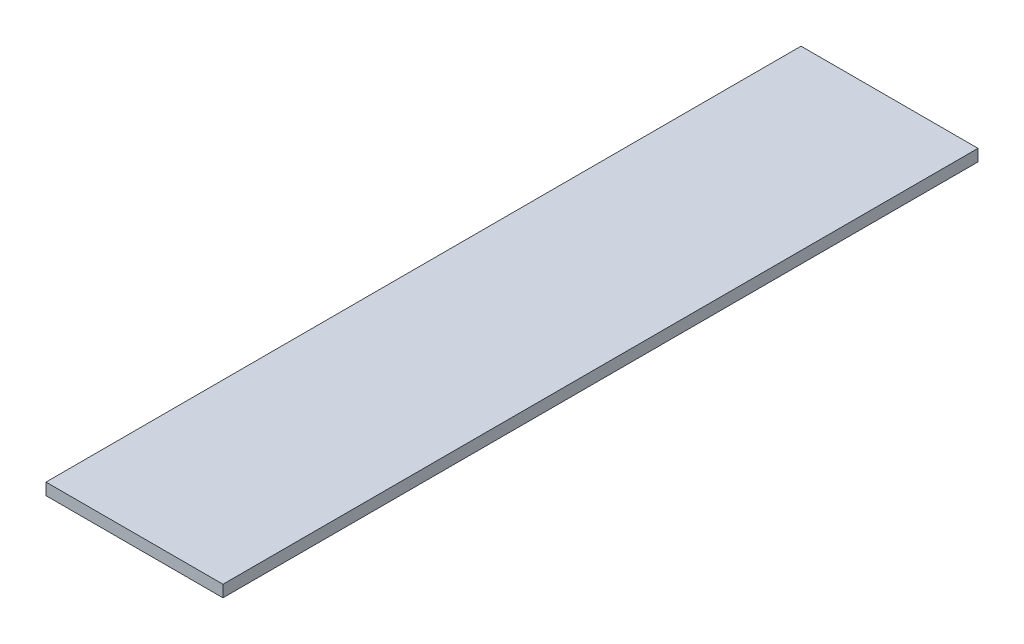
ISO-10303-21;
HEADER;
FILE_DESCRIPTION(('STEP AP214'),'2;1');
FILE_NAME('part.step','',(''),(''),'','','');
FILE_SCHEMA(('AUTOMOTIVE_DESIGN { 1 0 10303 214 1 1 1 1 }'));
ENDSEC;
DATA;
#1=APPLICATION_CONTEXT('core data for automotive mechanical design processes');
#2=APPLICATION_PROTOCOL_DEFINITION('international standard','automotive_design',2000,#1);
#3=PRODUCT_CONTEXT('',#1,'mechanical');
#4=PRODUCT('Part','Part','',(#3));
#5=PRODUCT_RELATED_PRODUCT_CATEGORY('part','',(#4));
#6=PRODUCT_DEFINITION_FORMATION('','',#4);
#7=PRODUCT_DEFINITION_CONTEXT('part definition',#1,'design');
#8=PRODUCT_DEFINITION('design','',#6,#7);
#9=PRODUCT_DEFINITION_SHAPE('','',#8);
#10=(LENGTH_UNIT() NAMED_UNIT(*) SI_UNIT(.MILLI.,.METRE.));
#11=(NAMED_UNIT(*) PLANE_ANGLE_UNIT() SI_UNIT($,.RADIAN.));
#12=(NAMED_UNIT(*) SI_UNIT($,.STERADIAN.) SOLID_ANGLE_UNIT());
#13=UNCERTAINTY_MEASURE_WITH_UNIT(LENGTH_MEASURE(1.E-05),#10,'distance_accuracy_value','');
#14=(GEOMETRIC_REPRESENTATION_CONTEXT(3) GLOBAL_UNCERTAINTY_ASSIGNED_CONTEXT((#13)) GLOBAL_UNIT_ASSIGNED_CONTEXT((#10,
#11,#12)) REPRESENTATION_CONTEXT('',''));
#15=CARTESIAN_POINT('',(0.,0.,0.));
#16=DIRECTION('',(0.,0.,1.));
#17=DIRECTION('',(1.,0.,0.));
#18=AXIS2_PLACEMENT_3D('',#15,#16,#17);
#19=CARTESIAN_POINT('',(0.,0.,-64.));
#20=DIRECTION('',(-1.,0.,0.));
#21=DIRECTION('',(0.,0.,1.));
#22=AXIS2_PLACEMENT_3D('',#19,#20,#21);
#23=PLANE('',#22);
#24=DIRECTION('',(0.,-1.,0.));
#25=VECTOR('',#24,1.);
#26=CARTESIAN_POINT('',(0.,0.,0.));
#27=LINE('',#26,#25);
#28=CARTESIAN_POINT('',(0.,1.,0.));
#29=VERTEX_POINT('',#28);
#30=CARTESIAN_POINT('',(0.,0.,0.));
#31=VERTEX_POINT('',#30);
#32=EDGE_CURVE('E66',#29,#31,#27,.T.);
#33=ORIENTED_EDGE('',*,*,#32,.F.);
#34=DIRECTION('',(0.,0.,1.));
#35=VECTOR('',#34,1.);
#36=CARTESIAN_POINT('',(0.,1.,-64.));
#37=LINE('',#36,#35);
#38=CARTESIAN_POINT('',(0.,1.,-64.));
#39=VERTEX_POINT('',#38);
#40=EDGE_CURVE('E11',#39,#29,#37,.T.);
#41=ORIENTED_EDGE('',*,*,#40,.F.);
#42=DIRECTION('',(0.,-1.,0.));
#43=VECTOR('',#42,1.);
#44=CARTESIAN_POINT('',(0.,0.,-64.));
#45=LINE('',#44,#43);
#46=CARTESIAN_POINT('',(0.,0.,-64.));
#47=VERTEX_POINT('',#46);
#48=EDGE_CURVE('E68',#39,#47,#45,.T.);
#49=ORIENTED_EDGE('',*,*,#48,.T.);
#50=DIRECTION('',(0.,0.,1.));
#51=VECTOR('',#50,1.);
#52=CARTESIAN_POINT('',(0.,0.,-64.));
#53=LINE('',#52,#51);
#54=EDGE_CURVE('E29',#47,#31,#53,.T.);
#55=ORIENTED_EDGE('',*,*,#54,.T.);
#56=EDGE_LOOP('',(#33,#41,#49,#55));
#57=FACE_BOUND('',#56,.T.);
#58=ADVANCED_FACE('F26',(#57),#23,.T.);
#59=CARTESIAN_POINT('',(0.,1.,-64.));
#60=DIRECTION('',(0.,1.,0.));
#61=DIRECTION('',(0.,0.,1.));
#62=AXIS2_PLACEMENT_3D('',#59,#60,#61);
#63=PLANE('',#62);
#64=DIRECTION('',(-1.,0.,0.));
#65=VECTOR('',#64,1.);
#66=CARTESIAN_POINT('',(0.,1.,0.));
#67=LINE('',#66,#65);
#68=CARTESIAN_POINT('',(15.,1.,0.));
#69=VERTEX_POINT('',#68);
#70=EDGE_CURVE('E83',#69,#29,#67,.T.);
#71=ORIENTED_EDGE('',*,*,#70,.F.);
#72=DIRECTION('',(0.,0.,1.));
#73=VECTOR('',#72,1.);
#74=CARTESIAN_POINT('',(15.,1.,-64.));
#75=LINE('',#74,#73);
#76=CARTESIAN_POINT('',(15.,1.,-64.));
#77=VERTEX_POINT('',#76);
#78=EDGE_CURVE('E34',#77,#69,#75,.T.);
#79=ORIENTED_EDGE('',*,*,#78,.F.);
#80=DIRECTION('',(-1.,0.,0.));
#81=VECTOR('',#80,1.);
#82=CARTESIAN_POINT('',(0.,1.,-64.));
#83=LINE('',#82,#81);
#84=EDGE_CURVE('E73',#77,#39,#83,.T.);
#85=ORIENTED_EDGE('',*,*,#84,.T.);
#86=ORIENTED_EDGE('',*,*,#40,.T.);
#87=EDGE_LOOP('',(#71,#79,#85,#86));
#88=FACE_BOUND('',#87,.T.);
#89=ADVANCED_FACE('F98',(#88),#63,.T.);
#90=CARTESIAN_POINT('',(15.,0.,-64.));
#91=DIRECTION('',(1.,0.,0.));
#92=DIRECTION('',(0.,0.,-1.));
#93=AXIS2_PLACEMENT_3D('',#90,#91,#92);
#94=PLANE('',#93);
#95=DIRECTION('',(0.,1.,0.));
#96=VECTOR('',#95,1.);
#97=CARTESIAN_POINT('',(15.,0.,0.));
#98=LINE('',#97,#96);
#99=CARTESIAN_POINT('',(15.,0.,0.));
#100=VERTEX_POINT('',#99);
#101=EDGE_CURVE('E80',#100,#69,#98,.T.);
#102=ORIENTED_EDGE('',*,*,#101,.F.);
#103=DIRECTION('',(0.,0.,1.));
#104=VECTOR('',#103,1.);
#105=CARTESIAN_POINT('',(15.,0.,-64.));
#106=LINE('',#105,#104);
#107=CARTESIAN_POINT('',(15.,0.,-64.));
#108=VERTEX_POINT('',#107);
#109=EDGE_CURVE('E72',#108,#100,#106,.T.);
#110=ORIENTED_EDGE('',*,*,#109,.F.);
#111=DIRECTION('',(0.,1.,0.));
#112=VECTOR('',#111,1.);
#113=CARTESIAN_POINT('',(15.,0.,-64.));
#114=LINE('',#113,#112);
#115=EDGE_CURVE('E91',#108,#77,#114,.T.);
#116=ORIENTED_EDGE('',*,*,#115,.T.);
#117=ORIENTED_EDGE('',*,*,#78,.T.);
#118=EDGE_LOOP('',(#102,#110,#116,#117));
#119=FACE_BOUND('',#118,.T.);
#120=ADVANCED_FACE('F95',(#119),#94,.T.);
#121=CARTESIAN_POINT('',(0.,0.,-64.));
#122=DIRECTION('',(0.,-1.,0.));
#123=DIRECTION('',(0.,0.,-1.));
#124=AXIS2_PLACEMENT_3D('',#121,#122,#123);
#125=PLANE('',#124);
#126=DIRECTION('',(1.,0.,0.));
#127=VECTOR('',#126,1.);
#128=CARTESIAN_POINT('',(0.,0.,0.));
#129=LINE('',#128,#127);
#130=EDGE_CURVE('E75',#31,#100,#129,.T.);
#131=ORIENTED_EDGE('',*,*,#130,.F.);
#132=ORIENTED_EDGE('',*,*,#54,.F.);
#133=DIRECTION('',(1.,0.,0.));
#134=VECTOR('',#133,1.);
#135=CARTESIAN_POINT('',(0.,0.,-64.));
#136=LINE('',#135,#134);
#137=EDGE_CURVE('E89',#47,#108,#136,.T.);
#138=ORIENTED_EDGE('',*,*,#137,.T.);
#139=ORIENTED_EDGE('',*,*,#109,.T.);
#140=EDGE_LOOP('',(#131,#132,#138,#139));
#141=FACE_BOUND('',#140,.T.);
#142=ADVANCED_FACE('F76',(#141),#125,.T.);
#143=CARTESIAN_POINT('',(0.,1.,-64.));
#144=DIRECTION('',(0.,0.,-1.));
#145=DIRECTION('',(-1.,0.,0.));
#146=AXIS2_PLACEMENT_3D('',#143,#144,#145);
#147=PLANE('',#146);
#148=ORIENTED_EDGE('',*,*,#48,.F.);
#149=ORIENTED_EDGE('',*,*,#84,.F.);
#150=ORIENTED_EDGE('',*,*,#115,.F.);
#151=ORIENTED_EDGE('',*,*,#137,.F.);
#152=EDGE_LOOP('',(#148,#149,#150,#151));
#153=FACE_BOUND('',#152,.T.);
#154=ADVANCED_FACE('F100',(#153),#147,.T.);
#155=CARTESIAN_POINT('',(0.,1.,0.));
#156=DIRECTION('',(0.,0.,-1.));
#157=DIRECTION('',(-1.,0.,0.));
#158=AXIS2_PLACEMENT_3D('',#155,#156,#157);
#159=PLANE('',#158);
#160=ORIENTED_EDGE('',*,*,#32,.T.);
#161=ORIENTED_EDGE('',*,*,#130,.T.);
#162=ORIENTED_EDGE('',*,*,#101,.T.);
#163=ORIENTED_EDGE('',*,*,#70,.T.);
#164=EDGE_LOOP('',(#160,#161,#162,#163));
#165=FACE_BOUND('',#164,.T.);
#166=ADVANCED_FACE('F82',(#165),#159,.F.);
#167=CLOSED_SHELL('',(#58,#89,#120,#142,#154,#166));
#168=MANIFOLD_SOLID_BREP('B2',#167);
#169=ADVANCED_BREP_SHAPE_REPRESENTATION('',(#18,#168),#14);
#170=SHAPE_DEFINITION_REPRESENTATION(#9,#169);
ENDSEC;
END-ISO-10303-21;
